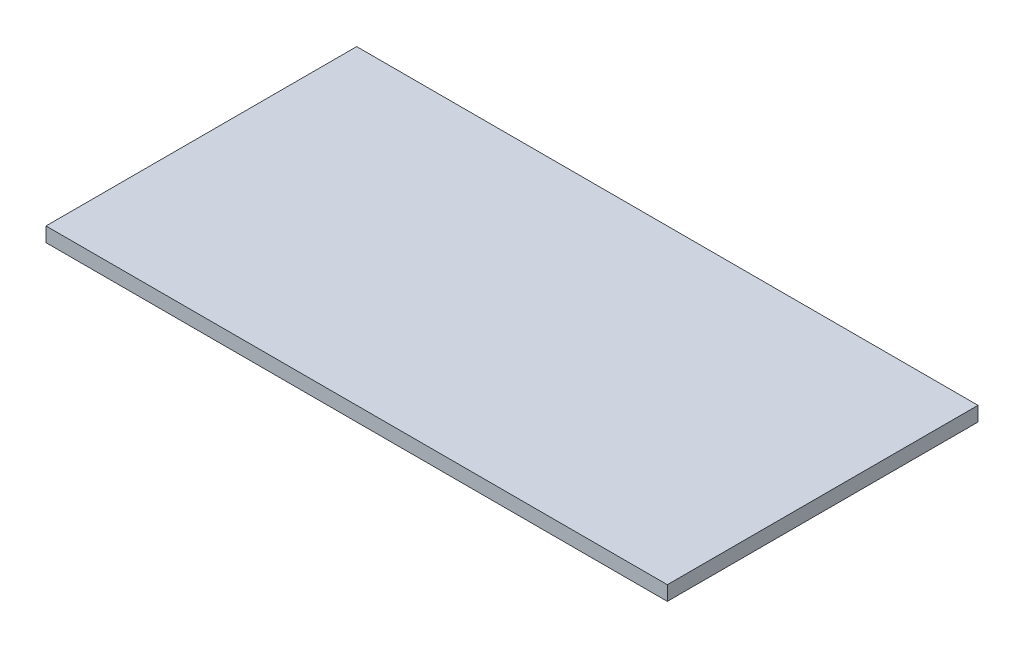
from build123d import *

# Parameters (mm, degrees)
BOSS_EXTRUDE1_DEPTH = 5
BOSS_EXTRUDE1_DRAFT = -45
SKETCH2_W           = 1200
SKETCH2_H           = 600
BOSS_EXTRUDE2_DEPTH = 28
FILLET1_R           = 2


with BuildPart() as part:
    # Sketch1 → Boss-Extrude1 (with draft: the straight prism first)
    with BuildSketch(Plane(origin=(0, 0, 0), x_dir=(1, 0, 0), z_dir=(0, 1, 0))):
        with BuildLine():
            ThreePointArc((-560, 280), (-574.142135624, 274.142135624), (-580, 260))
            Line((-580, 260), (-580, -260))
            ThreePointArc((-580, -260), (-574.142135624, -274.142135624), (-560, -280))
            Line((-560, -280), (560, -280))
            ThreePointArc((560, -280), (574.142135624, -274.142135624), (580, -260))
            Line((580, -260), (580, 260))
            ThreePointArc((580, 260), (574.142135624, 274.142135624), (560, 280))
            Line((560, 280), (-560, 280))
        make_face()
    extrude(amount=-BOSS_EXTRUDE1_DEPTH)
    # Boss-Extrude1: the draft: its side faces are tilted about the plane it starts from
    boss_extrude1_sides = [part.faces().sort_by_distance(p)[0] for p in [
        (-574.142135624, -2.5, -274.142135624),
        (-580, -2.5, 0),
        (-574.142135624, -2.5, 274.142135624),
        (0, -2.5, 280),
        (574.142135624, -2.5, 274.142135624),
        (580, -2.5, 0),
        (574.142135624, -2.5, -274.142135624),
        (0, -2.5, -280),
    ]]
    draft(boss_extrude1_sides, Plane(origin=(0, 0, 0), x_dir=(1, 0, 0), z_dir=(0, 1, 0)), BOSS_EXTRUDE1_DRAFT)

    # Sketch2 → Boss-Extrude2 (add)
    with BuildSketch(Plane(origin=(0, 0, 0), x_dir=(1, 0, 0), z_dir=(0, 1, 0))):
        Rectangle(SKETCH2_W, SKETCH2_H)
    extrude(amount=BOSS_EXTRUDE2_DEPTH)

    # Fillet1
    fillet1_edges = [part.edges().sort_by_distance(p)[0] for p in [
        (-570.606601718, -5, -270.606601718),
        (0, 0, -280),
        (574.142135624, 0, -274.142135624),
        (-575, -5, 0),
        (-570.606601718, -5, 270.606601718),
        (0, -5, 275),
        (570.606601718, -5, 270.606601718),
        (575, -5, 0),
        (570.606601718, -5, -270.606601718),
        (0, -5, -275),
        (580, 0, 0),
        (574.142135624, 0, 274.142135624),
        (0, 0, 280),
        (-574.142135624, 0, 274.142135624),
        (-580, 0, 0),
        (-574.142135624, 0, -274.142135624),
    ]]
    fillet(fillet1_edges, radius=FILLET1_R)


solid = part.part
